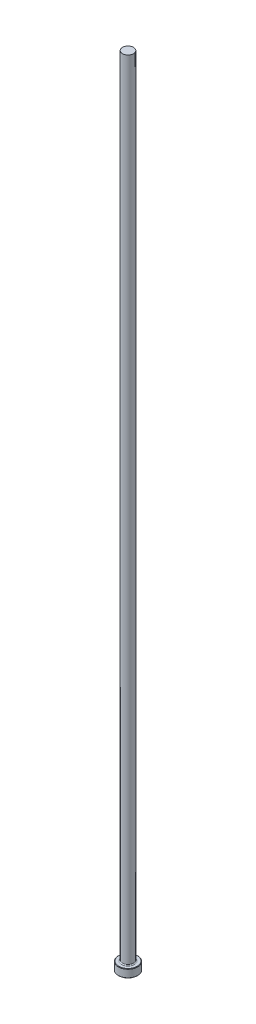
ISO-10303-21;
HEADER;
FILE_DESCRIPTION(('STEP AP214'),'2;1');
FILE_NAME('part.step','',(''),(''),'','','');
FILE_SCHEMA(('AUTOMOTIVE_DESIGN { 1 0 10303 214 1 1 1 1 }'));
ENDSEC;
DATA;
#1=APPLICATION_CONTEXT('core data for automotive mechanical design processes');
#2=APPLICATION_PROTOCOL_DEFINITION('international standard','automotive_design',2000,#1);
#3=PRODUCT_CONTEXT('',#1,'mechanical');
#4=PRODUCT('Part','Part','',(#3));
#5=PRODUCT_RELATED_PRODUCT_CATEGORY('part','',(#4));
#6=PRODUCT_DEFINITION_FORMATION('','',#4);
#7=PRODUCT_DEFINITION_CONTEXT('part definition',#1,'design');
#8=PRODUCT_DEFINITION('design','',#6,#7);
#9=PRODUCT_DEFINITION_SHAPE('','',#8);
#10=(LENGTH_UNIT() NAMED_UNIT(*) SI_UNIT(.MILLI.,.METRE.));
#11=(NAMED_UNIT(*) PLANE_ANGLE_UNIT() SI_UNIT($,.RADIAN.));
#12=(NAMED_UNIT(*) SI_UNIT($,.STERADIAN.) SOLID_ANGLE_UNIT());
#13=UNCERTAINTY_MEASURE_WITH_UNIT(LENGTH_MEASURE(1.E-05),#10,'distance_accuracy_value','');
#14=(GEOMETRIC_REPRESENTATION_CONTEXT(3) GLOBAL_UNCERTAINTY_ASSIGNED_CONTEXT((#13)) GLOBAL_UNIT_ASSIGNED_CONTEXT((#10,
#11,#12)) REPRESENTATION_CONTEXT('',''));
#15=CARTESIAN_POINT('',(0.,0.,0.));
#16=DIRECTION('',(0.,0.,1.));
#17=DIRECTION('',(1.,0.,0.));
#18=AXIS2_PLACEMENT_3D('',#15,#16,#17);
#19=CARTESIAN_POINT('',(0.,0.,0.));
#20=DIRECTION('',(0.,-1.,0.));
#21=DIRECTION('',(0.,0.,-1.));
#22=AXIS2_PLACEMENT_3D('',#19,#20,#21);
#23=PLANE('',#22);
#24=CARTESIAN_POINT('',(0.,0.,0.));
#25=DIRECTION('',(0.,-1.,0.));
#26=DIRECTION('',(0.,0.,-1.));
#27=AXIS2_PLACEMENT_3D('',#24,#25,#26);
#28=CIRCLE('',#27,5.29589999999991);
#29=CARTESIAN_POINT('',(0.,0.,-5.29589999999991));
#30=VERTEX_POINT('',#29);
#31=EDGE_CURVE('E46',#30,#30,#28,.T.);
#32=ORIENTED_EDGE('',*,*,#31,.T.);
#33=EDGE_LOOP('',(#32));
#34=FACE_BOUND('',#33,.T.);
#35=ADVANCED_FACE('F35',(#34),#23,.T.);
#36=CARTESIAN_POINT('',(0.,259.958771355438,0.));
#37=DIRECTION('',(0.,1.,0.));
#38=DIRECTION('',(0.,0.,1.));
#39=AXIS2_PLACEMENT_3D('',#36,#37,#38);
#40=CYLINDRICAL_SURFACE('',#39,5.54989999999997);
#41=CARTESIAN_POINT('',(0.,4.49580000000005,0.));
#42=DIRECTION('',(0.,1.,0.));
#43=DIRECTION('',(0.,0.,1.));
#44=AXIS2_PLACEMENT_3D('',#41,#42,#43);
#45=CIRCLE('',#44,5.54989999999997);
#46=CARTESIAN_POINT('',(0.,4.49580000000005,5.54989999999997));
#47=VERTEX_POINT('',#46);
#48=EDGE_CURVE('E50',#47,#47,#45,.F.);
#49=ORIENTED_EDGE('',*,*,#48,.T.);
#50=EDGE_LOOP('',(#49));
#51=FACE_BOUND('',#50,.T.);
#52=CARTESIAN_POINT('',(0.,0.254000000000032,0.));
#53=DIRECTION('',(0.,-1.,0.));
#54=DIRECTION('',(0.,0.,-1.));
#55=AXIS2_PLACEMENT_3D('',#52,#53,#54);
#56=CIRCLE('',#55,5.54989999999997);
#57=CARTESIAN_POINT('',(0.,0.254000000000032,-5.54989999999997));
#58=VERTEX_POINT('',#57);
#59=EDGE_CURVE('E55',#58,#58,#56,.F.);
#60=ORIENTED_EDGE('',*,*,#59,.T.);
#61=EDGE_LOOP('',(#60));
#62=FACE_BOUND('',#61,.T.);
#63=ADVANCED_FACE('F77',(#51,#62),#40,.T.);
#64=CARTESIAN_POINT('',(-5.54989999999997,4.7498,0.));
#65=DIRECTION('',(0.,1.,0.));
#66=DIRECTION('',(0.,0.,1.));
#67=AXIS2_PLACEMENT_3D('',#64,#65,#66);
#68=PLANE('',#67);
#69=CARTESIAN_POINT('',(0.,4.7498,0.));
#70=DIRECTION('',(0.,1.,0.));
#71=DIRECTION('',(0.,0.,1.));
#72=AXIS2_PLACEMENT_3D('',#69,#70,#71);
#73=CIRCLE('',#72,3.68299999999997);
#74=CARTESIAN_POINT('',(0.,4.7498,3.68299999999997));
#75=VERTEX_POINT('',#74);
#76=EDGE_CURVE('E10',#75,#75,#73,.F.);
#77=ORIENTED_EDGE('',*,*,#76,.T.);
#78=EDGE_LOOP('',(#77));
#79=FACE_BOUND('',#78,.T.);
#80=CARTESIAN_POINT('',(0.,4.7498,0.));
#81=DIRECTION('',(0.,1.,0.));
#82=DIRECTION('',(0.,0.,1.));
#83=AXIS2_PLACEMENT_3D('',#80,#81,#82);
#84=CIRCLE('',#83,5.29590000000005);
#85=CARTESIAN_POINT('',(0.,4.7498,5.29590000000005));
#86=VERTEX_POINT('',#85);
#87=EDGE_CURVE('E58',#86,#86,#84,.T.);
#88=ORIENTED_EDGE('',*,*,#87,.T.);
#89=EDGE_LOOP('',(#88));
#90=FACE_BOUND('',#89,.T.);
#91=ADVANCED_FACE('F69',(#79,#90),#68,.T.);
#92=CARTESIAN_POINT('',(0.,259.958771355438,0.));
#93=DIRECTION('',(0.,1.,0.));
#94=DIRECTION('',(0.,0.,1.));
#95=AXIS2_PLACEMENT_3D('',#92,#93,#94);
#96=CYLINDRICAL_SURFACE('',#95,3.17499999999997);
#97=CARTESIAN_POINT('',(0.,5.25779999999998,0.));
#98=DIRECTION('',(0.,1.,0.));
#99=DIRECTION('',(0.,0.,1.));
#100=AXIS2_PLACEMENT_3D('',#97,#98,#99);
#101=CIRCLE('',#100,3.17499999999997);
#102=CARTESIAN_POINT('',(0.,5.25779999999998,3.17499999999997));
#103=VERTEX_POINT('',#102);
#104=EDGE_CURVE('E42',#103,#103,#101,.T.);
#105=ORIENTED_EDGE('',*,*,#104,.T.);
#106=EDGE_LOOP('',(#105));
#107=FACE_BOUND('',#106,.T.);
#108=CARTESIAN_POINT('',(0.,457.2,0.));
#109=DIRECTION('',(0.,1.,0.));
#110=DIRECTION('',(0.,0.,1.));
#111=AXIS2_PLACEMENT_3D('',#108,#109,#110);
#112=CIRCLE('',#111,3.17499999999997);
#113=CARTESIAN_POINT('',(0.,457.2,3.17499999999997));
#114=VERTEX_POINT('',#113);
#115=EDGE_CURVE('E61',#114,#114,#112,.T.);
#116=ORIENTED_EDGE('',*,*,#115,.F.);
#117=EDGE_LOOP('',(#116));
#118=FACE_BOUND('',#117,.T.);
#119=ADVANCED_FACE('F67',(#107,#118),#96,.T.);
#120=CARTESIAN_POINT('',(-3.17499999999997,457.2,0.));
#121=DIRECTION('',(0.,1.,0.));
#122=DIRECTION('',(0.,0.,1.));
#123=AXIS2_PLACEMENT_3D('',#120,#121,#122);
#124=PLANE('',#123);
#125=ORIENTED_EDGE('',*,*,#115,.T.);
#126=EDGE_LOOP('',(#125));
#127=FACE_BOUND('',#126,.T.);
#128=ADVANCED_FACE('F65',(#127),#124,.T.);
#129=CARTESIAN_POINT('',(0.,4.74980000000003,0.));
#130=DIRECTION('',(0.,-1.,0.));
#131=DIRECTION('',(0.,0.,-1.));
#132=AXIS2_PLACEMENT_3D('',#129,#130,#131);
#133=CONICAL_SURFACE('',#132,5.29590000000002,0.785398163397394);
#134=ORIENTED_EDGE('',*,*,#48,.F.);
#135=EDGE_LOOP('',(#134));
#136=FACE_BOUND('',#135,.T.);
#137=ORIENTED_EDGE('',*,*,#87,.F.);
#138=EDGE_LOOP('',(#137));
#139=FACE_BOUND('',#138,.T.);
#140=ADVANCED_FACE('F75',(#136,#139),#133,.T.);
#141=CARTESIAN_POINT('',(0.,0.254000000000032,0.));
#142=DIRECTION('',(0.,1.,0.));
#143=DIRECTION('',(0.,0.,1.));
#144=AXIS2_PLACEMENT_3D('',#141,#142,#143);
#145=CONICAL_SURFACE('',#144,5.54989999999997,0.785398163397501);
#146=ORIENTED_EDGE('',*,*,#31,.F.);
#147=EDGE_LOOP('',(#146));
#148=FACE_BOUND('',#147,.T.);
#149=ORIENTED_EDGE('',*,*,#59,.F.);
#150=EDGE_LOOP('',(#149));
#151=FACE_BOUND('',#150,.T.);
#152=ADVANCED_FACE('F89',(#148,#151),#145,.T.);
#153=CARTESIAN_POINT('',(0.,5.25779999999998,0.));
#154=DIRECTION('',(0.,1.,0.));
#155=DIRECTION('',(0.,0.,1.));
#156=AXIS2_PLACEMENT_3D('',#153,#154,#155);
#157=TOROIDAL_SURFACE('',#156,3.68299999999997,0.508);
#158=ORIENTED_EDGE('',*,*,#76,.F.);
#159=EDGE_LOOP('',(#158));
#160=FACE_BOUND('',#159,.T.);
#161=ORIENTED_EDGE('',*,*,#104,.F.);
#162=EDGE_LOOP('',(#161));
#163=FACE_BOUND('',#162,.T.);
#164=ADVANCED_FACE('F37',(#160,#163),#157,.F.);
#165=CLOSED_SHELL('',(#35,#63,#91,#119,#128,#140,#152,#164));
#166=MANIFOLD_SOLID_BREP('B2',#165);
#167=ADVANCED_BREP_SHAPE_REPRESENTATION('',(#18,#166),#14);
#168=SHAPE_DEFINITION_REPRESENTATION(#9,#167);
ENDSEC;
END-ISO-10303-21;
